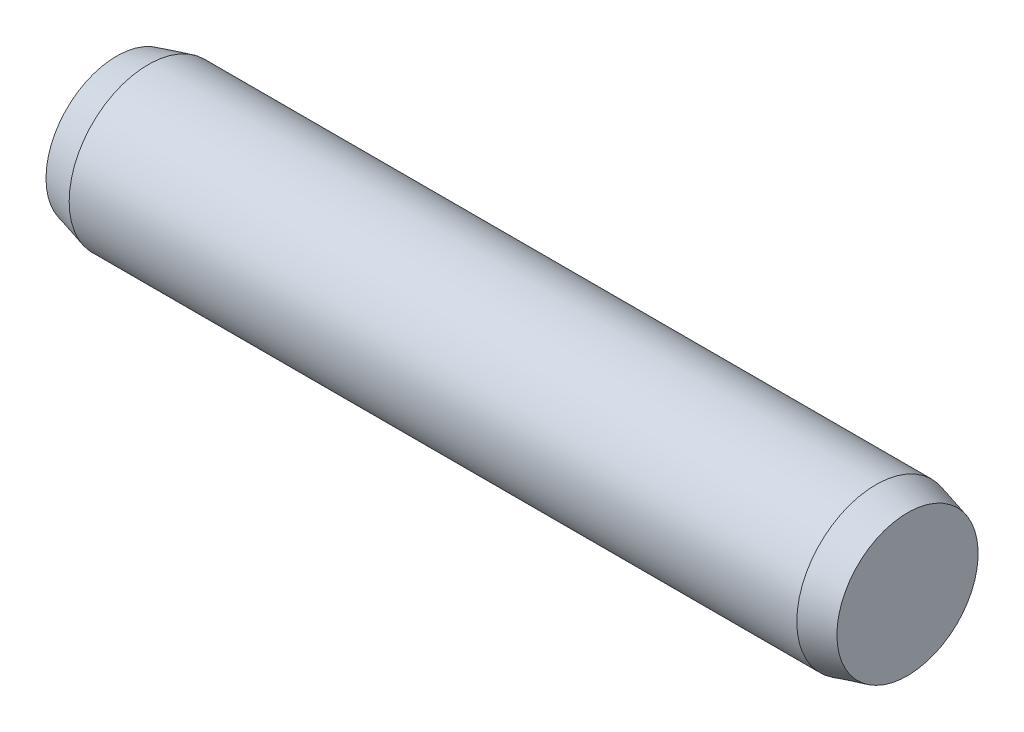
from build123d import *


with BuildPart() as part:
    # Sketch1 → Base-Revolve (revolve)
    with BuildSketch(Plane.XY, mode=Mode.PRIVATE) as base_revolve_sk:
        Polygon((0, 0), (40, 0), (40, 3.571281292), (38.4, 4), (1.6, 4), (0, 3.571281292), align=None)
    revolve(base_revolve_sk.sketch.rotate(Axis((-6.35, 0, 0), (1, 0, 0)), 90), axis=Axis((-6.35, 0, 0), (1, 0, 0)))


solid = part.part
